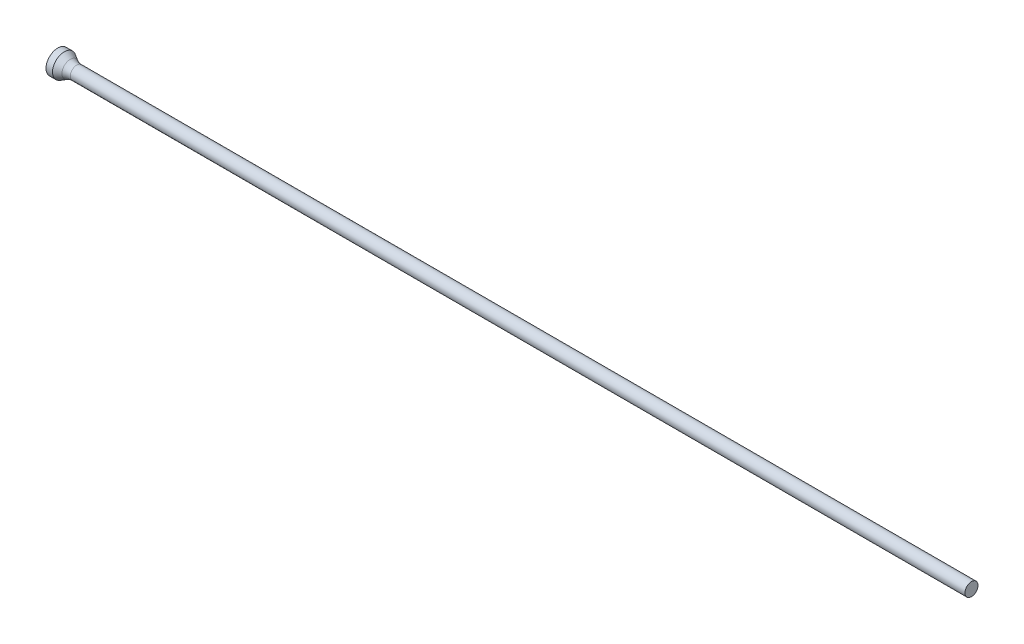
ISO-10303-21;
HEADER;
FILE_DESCRIPTION(('STEP AP214'),'2;1');
FILE_NAME('part.step','',(''),(''),'','','');
FILE_SCHEMA(('AUTOMOTIVE_DESIGN { 1 0 10303 214 1 1 1 1 }'));
ENDSEC;
DATA;
#1=APPLICATION_CONTEXT('core data for automotive mechanical design processes');
#2=APPLICATION_PROTOCOL_DEFINITION('international standard','automotive_design',2000,#1);
#3=PRODUCT_CONTEXT('',#1,'mechanical');
#4=PRODUCT('Part','Part','',(#3));
#5=PRODUCT_RELATED_PRODUCT_CATEGORY('part','',(#4));
#6=PRODUCT_DEFINITION_FORMATION('','',#4);
#7=PRODUCT_DEFINITION_CONTEXT('part definition',#1,'design');
#8=PRODUCT_DEFINITION('design','',#6,#7);
#9=PRODUCT_DEFINITION_SHAPE('','',#8);
#10=(LENGTH_UNIT() NAMED_UNIT(*) SI_UNIT(.MILLI.,.METRE.));
#11=(NAMED_UNIT(*) PLANE_ANGLE_UNIT() SI_UNIT($,.RADIAN.));
#12=(NAMED_UNIT(*) SI_UNIT($,.STERADIAN.) SOLID_ANGLE_UNIT());
#13=UNCERTAINTY_MEASURE_WITH_UNIT(LENGTH_MEASURE(1.E-05),#10,'distance_accuracy_value','');
#14=(GEOMETRIC_REPRESENTATION_CONTEXT(3) GLOBAL_UNCERTAINTY_ASSIGNED_CONTEXT((#13)) GLOBAL_UNIT_ASSIGNED_CONTEXT((#10,
#11,#12)) REPRESENTATION_CONTEXT('',''));
#15=CARTESIAN_POINT('',(0.,0.,0.));
#16=DIRECTION('',(0.,0.,1.));
#17=DIRECTION('',(1.,0.,0.));
#18=AXIS2_PLACEMENT_3D('',#15,#16,#17);
#19=CARTESIAN_POINT('',(0.,0.,0.));
#20=DIRECTION('',(1.,0.,0.));
#21=DIRECTION('',(0.,0.,-1.));
#22=AXIS2_PLACEMENT_3D('',#19,#20,#21);
#23=PLANE('',#22);
#24=CARTESIAN_POINT('',(0.,0.,0.));
#25=DIRECTION('',(-1.,0.,0.));
#26=DIRECTION('',(0.,0.,1.));
#27=AXIS2_PLACEMENT_3D('',#24,#25,#26);
#28=CIRCLE('',#27,0.9);
#29=CARTESIAN_POINT('',(0.,0.,0.9));
#30=VERTEX_POINT('',#29);
#31=EDGE_CURVE('E30',#30,#30,#28,.T.);
#32=ORIENTED_EDGE('',*,*,#31,.T.);
#33=EDGE_LOOP('',(#32));
#34=FACE_BOUND('',#33,.T.);
#35=ADVANCED_FACE('F14',(#34),#23,.F.);
#36=CARTESIAN_POINT('',(0.,0.,0.));
#37=DIRECTION('',(-1.,0.,0.));
#38=DIRECTION('',(0.,0.,1.));
#39=AXIS2_PLACEMENT_3D('',#36,#37,#38);
#40=CYLINDRICAL_SURFACE('',#39,0.9);
#41=ORIENTED_EDGE('',*,*,#31,.F.);
#42=EDGE_LOOP('',(#41));
#43=FACE_BOUND('',#42,.T.);
#44=CARTESIAN_POINT('',(0.497179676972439,0.,0.));
#45=DIRECTION('',(-1.,0.,0.));
#46=DIRECTION('',(0.,0.,1.));
#47=AXIS2_PLACEMENT_3D('',#44,#45,#46);
#48=CIRCLE('',#47,0.9);
#49=CARTESIAN_POINT('',(0.497179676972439,0.,0.9));
#50=VERTEX_POINT('',#49);
#51=EDGE_CURVE('E35',#50,#50,#48,.T.);
#52=ORIENTED_EDGE('',*,*,#51,.T.);
#53=EDGE_LOOP('',(#52));
#54=FACE_BOUND('',#53,.T.);
#55=ADVANCED_FACE('F57',(#43,#54),#40,.T.);
#56=CARTESIAN_POINT('',(1.19,0.,0.));
#57=DIRECTION('',(-1.,0.,0.));
#58=DIRECTION('',(0.,0.,1.));
#59=AXIS2_PLACEMENT_3D('',#56,#57,#58);
#60=CONICAL_SURFACE('',#59,0.5,0.523598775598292);
#61=CARTESIAN_POINT('',(0.957949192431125,0.,0.));
#62=DIRECTION('',(-1.,0.,0.));
#63=DIRECTION('',(0.,0.,1.));
#64=AXIS2_PLACEMENT_3D('',#61,#62,#63);
#65=CIRCLE('',#64,0.633974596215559);
#66=CARTESIAN_POINT('',(0.957949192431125,0.,0.633974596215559));
#67=VERTEX_POINT('',#66);
#68=EDGE_CURVE('E22',#67,#67,#65,.T.);
#69=ORIENTED_EDGE('',*,*,#68,.T.);
#70=EDGE_LOOP('',(#69));
#71=FACE_BOUND('',#70,.T.);
#72=ORIENTED_EDGE('',*,*,#51,.F.);
#73=EDGE_LOOP('',(#72));
#74=FACE_BOUND('',#73,.T.);
#75=ADVANCED_FACE('F54',(#71,#74),#60,.T.);
#76=CARTESIAN_POINT('',(0.,0.,0.));
#77=DIRECTION('',(-1.,0.,0.));
#78=DIRECTION('',(0.,0.,1.));
#79=AXIS2_PLACEMENT_3D('',#76,#77,#78);
#80=CYLINDRICAL_SURFACE('',#79,0.5);
#81=CARTESIAN_POINT('',(1.45794919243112,0.,0.));
#82=DIRECTION('',(-1.,0.,0.));
#83=DIRECTION('',(0.,0.,1.));
#84=AXIS2_PLACEMENT_3D('',#81,#82,#83);
#85=CIRCLE('',#84,0.5);
#86=CARTESIAN_POINT('',(1.45794919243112,0.,0.5));
#87=VERTEX_POINT('',#86);
#88=EDGE_CURVE('E9',#87,#87,#85,.F.);
#89=ORIENTED_EDGE('',*,*,#88,.T.);
#90=EDGE_LOOP('',(#89));
#91=FACE_BOUND('',#90,.T.);
#92=CARTESIAN_POINT('',(70.,0.,0.));
#93=DIRECTION('',(-1.,0.,0.));
#94=DIRECTION('',(0.,0.,1.));
#95=AXIS2_PLACEMENT_3D('',#92,#93,#94);
#96=CIRCLE('',#95,0.5);
#97=CARTESIAN_POINT('',(70.,0.,0.5));
#98=VERTEX_POINT('',#97);
#99=EDGE_CURVE('E40',#98,#98,#96,.T.);
#100=ORIENTED_EDGE('',*,*,#99,.T.);
#101=EDGE_LOOP('',(#100));
#102=FACE_BOUND('',#101,.T.);
#103=ADVANCED_FACE('F44',(#91,#102),#80,.T.);
#104=CARTESIAN_POINT('',(70.,0.5,0.));
#105=DIRECTION('',(-1.,0.,0.));
#106=DIRECTION('',(0.,0.,1.));
#107=AXIS2_PLACEMENT_3D('',#104,#105,#106);
#108=PLANE('',#107);
#109=ORIENTED_EDGE('',*,*,#99,.F.);
#110=EDGE_LOOP('',(#109));
#111=FACE_BOUND('',#110,.T.);
#112=ADVANCED_FACE('F46',(#111),#108,.F.);
#113=CARTESIAN_POINT('',(1.45794919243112,0.,0.));
#114=DIRECTION('',(-1.,0.,0.));
#115=DIRECTION('',(0.,0.,1.));
#116=AXIS2_PLACEMENT_3D('',#113,#114,#115);
#117=TOROIDAL_SURFACE('',#116,1.5,1.);
#118=ORIENTED_EDGE('',*,*,#88,.F.);
#119=EDGE_LOOP('',(#118));
#120=FACE_BOUND('',#119,.T.);
#121=ORIENTED_EDGE('',*,*,#68,.F.);
#122=EDGE_LOOP('',(#121));
#123=FACE_BOUND('',#122,.T.);
#124=ADVANCED_FACE('F16',(#120,#123),#117,.F.);
#125=CLOSED_SHELL('',(#35,#55,#75,#103,#112,#124));
#126=MANIFOLD_SOLID_BREP('B1',#125);
#127=ADVANCED_BREP_SHAPE_REPRESENTATION('',(#18,#126),#14);
#128=SHAPE_DEFINITION_REPRESENTATION(#9,#127);
ENDSEC;
END-ISO-10303-21;
